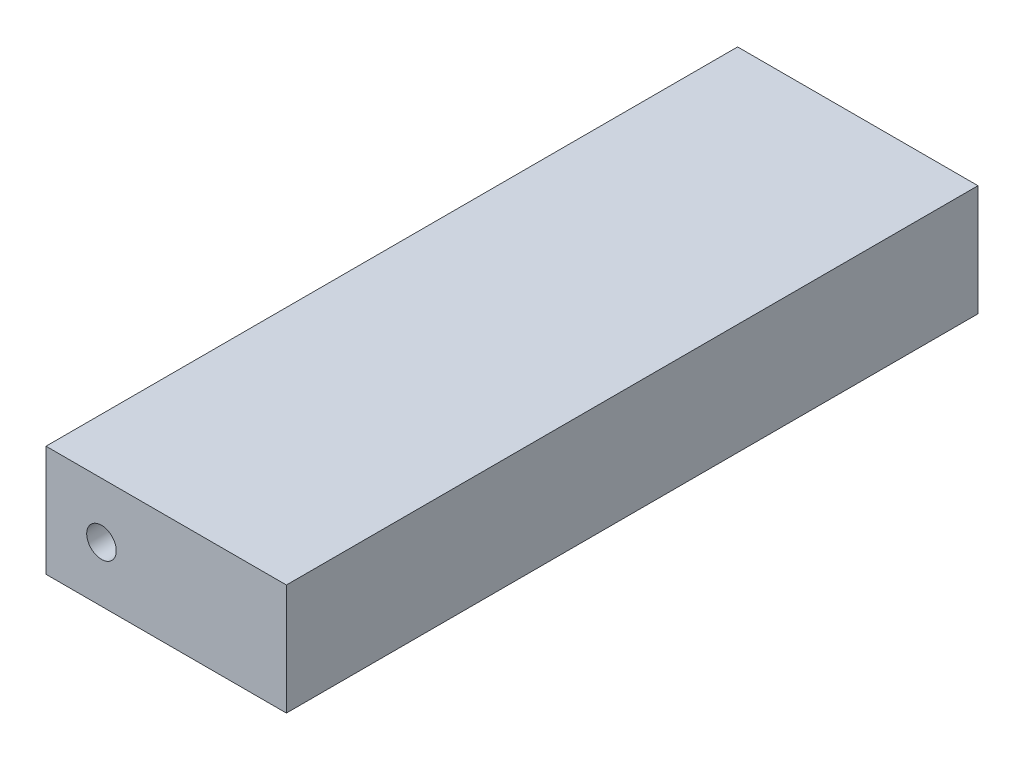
from build123d import *

# Parameters (mm, degrees)
ESQUISSE1_W             = 65
ESQUISSE1_H             = 30
EXTRUSION1_DEPTH        = 187
ESQUISSE2_R             = 4
ENL_V_MAT_EXTRU_1_DEPTH = 187


with BuildPart() as part:
    # Esquisse1 → Extrusion1 (new body)
    with BuildSketch(Plane.XY):
        with Locations((32.5, 15)):
            Rectangle(ESQUISSE1_W, ESQUISSE1_H)
    extrude(amount=EXTRUSION1_DEPTH)

    # Esquisse2 → Enl_v. mat.-Extru.1 (cut)
    with BuildSketch(Plane(origin=(0, 0, 0), x_dir=(-1, 0, 0), z_dir=(0, 0, -1))):
        with Locations((-15, 15)):
            Circle(ESQUISSE2_R)
    extrude(amount=-ENL_V_MAT_EXTRU_1_DEPTH, mode=Mode.SUBTRACT)


solid = part.part
